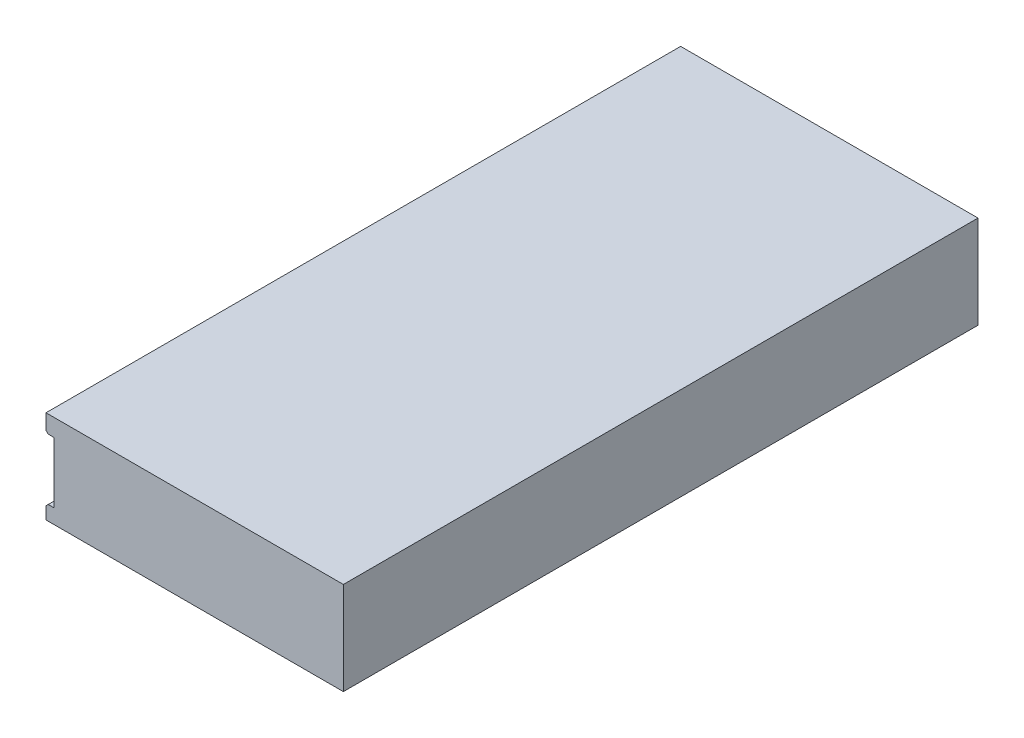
ISO-10303-21;
HEADER;
FILE_DESCRIPTION(('STEP AP214'),'2;1');
FILE_NAME('part.step','',(''),(''),'','','');
FILE_SCHEMA(('AUTOMOTIVE_DESIGN { 1 0 10303 214 1 1 1 1 }'));
ENDSEC;
DATA;
#1=APPLICATION_CONTEXT('core data for automotive mechanical design processes');
#2=APPLICATION_PROTOCOL_DEFINITION('international standard','automotive_design',2000,#1);
#3=PRODUCT_CONTEXT('',#1,'mechanical');
#4=PRODUCT('Part','Part','',(#3));
#5=PRODUCT_RELATED_PRODUCT_CATEGORY('part','',(#4));
#6=PRODUCT_DEFINITION_FORMATION('','',#4);
#7=PRODUCT_DEFINITION_CONTEXT('part definition',#1,'design');
#8=PRODUCT_DEFINITION('design','',#6,#7);
#9=PRODUCT_DEFINITION_SHAPE('','',#8);
#10=(LENGTH_UNIT() NAMED_UNIT(*) SI_UNIT(.MILLI.,.METRE.));
#11=(NAMED_UNIT(*) PLANE_ANGLE_UNIT() SI_UNIT($,.RADIAN.));
#12=(NAMED_UNIT(*) SI_UNIT($,.STERADIAN.) SOLID_ANGLE_UNIT());
#13=UNCERTAINTY_MEASURE_WITH_UNIT(LENGTH_MEASURE(1.E-05),#10,'distance_accuracy_value','');
#14=(GEOMETRIC_REPRESENTATION_CONTEXT(3) GLOBAL_UNCERTAINTY_ASSIGNED_CONTEXT((#13)) GLOBAL_UNIT_ASSIGNED_CONTEXT((#10,
#11,#12)) REPRESENTATION_CONTEXT('',''));
#15=CARTESIAN_POINT('',(0.,0.,0.));
#16=DIRECTION('',(0.,0.,1.));
#17=DIRECTION('',(1.,0.,0.));
#18=AXIS2_PLACEMENT_3D('',#15,#16,#17);
#19=CARTESIAN_POINT('',(-1.397,0.,55.5625));
#20=DIRECTION('',(0.,-1.,0.));
#21=DIRECTION('',(0.,0.,-1.));
#22=AXIS2_PLACEMENT_3D('',#19,#20,#21);
#23=PLANE('',#22);
#24=DIRECTION('',(-1.,0.,0.));
#25=VECTOR('',#24,1.);
#26=CARTESIAN_POINT('',(-1.397,0.,-55.5625));
#27=LINE('',#26,#25);
#28=CARTESIAN_POINT('',(50.673,0.,-55.5625));
#29=VERTEX_POINT('',#28);
#30=CARTESIAN_POINT('',(-1.397,0.,-55.5625));
#31=VERTEX_POINT('',#30);
#32=EDGE_CURVE('E180',#29,#31,#27,.T.);
#33=ORIENTED_EDGE('',*,*,#32,.T.);
#34=DIRECTION('',(0.,0.,-1.));
#35=VECTOR('',#34,1.);
#36=CARTESIAN_POINT('',(-1.397,0.,55.5625));
#37=LINE('',#36,#35);
#38=CARTESIAN_POINT('',(-1.397,0.,55.5625));
#39=VERTEX_POINT('',#38);
#40=EDGE_CURVE('E231',#39,#31,#37,.T.);
#41=ORIENTED_EDGE('',*,*,#40,.F.);
#42=DIRECTION('',(-1.,0.,0.));
#43=VECTOR('',#42,1.);
#44=CARTESIAN_POINT('',(-1.397,0.,55.5625));
#45=LINE('',#44,#43);
#46=CARTESIAN_POINT('',(50.673,0.,55.5625));
#47=VERTEX_POINT('',#46);
#48=EDGE_CURVE('E181',#47,#39,#45,.T.);
#49=ORIENTED_EDGE('',*,*,#48,.F.);
#50=DIRECTION('',(0.,0.,-1.));
#51=VECTOR('',#50,1.);
#52=CARTESIAN_POINT('',(50.673,0.,55.5625));
#53=LINE('',#52,#51);
#54=EDGE_CURVE('E200',#47,#29,#53,.T.);
#55=ORIENTED_EDGE('',*,*,#54,.T.);
#56=EDGE_LOOP('',(#33,#41,#49,#55));
#57=FACE_BOUND('',#56,.T.);
#58=ADVANCED_FACE('F37',(#57),#23,.F.);
#59=CARTESIAN_POINT('',(-1.397,-3.048,55.5625));
#60=DIRECTION('',(1.,0.,0.));
#61=DIRECTION('',(0.,0.,-1.));
#62=AXIS2_PLACEMENT_3D('',#59,#60,#61);
#63=PLANE('',#62);
#64=DIRECTION('',(0.,-1.,0.));
#65=VECTOR('',#64,1.);
#66=CARTESIAN_POINT('',(-1.397,-3.048,-55.5625));
#67=LINE('',#66,#65);
#68=CARTESIAN_POINT('',(-1.397,-2.66700000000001,-55.5625));
#69=VERTEX_POINT('',#68);
#70=EDGE_CURVE('E203',#31,#69,#67,.T.);
#71=ORIENTED_EDGE('',*,*,#70,.T.);
#72=DIRECTION('',(0.,0.,1.));
#73=VECTOR('',#72,1.);
#74=CARTESIAN_POINT('',(-1.397,-2.66700000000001,55.5625));
#75=LINE('',#74,#73);
#76=CARTESIAN_POINT('',(-1.397,-2.66700000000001,55.5625));
#77=VERTEX_POINT('',#76);
#78=EDGE_CURVE('E11',#69,#77,#75,.T.);
#79=ORIENTED_EDGE('',*,*,#78,.T.);
#80=DIRECTION('',(0.,-1.,0.));
#81=VECTOR('',#80,1.);
#82=CARTESIAN_POINT('',(-1.397,-3.048,55.5625));
#83=LINE('',#82,#81);
#84=EDGE_CURVE('E184',#39,#77,#83,.T.);
#85=ORIENTED_EDGE('',*,*,#84,.F.);
#86=ORIENTED_EDGE('',*,*,#40,.T.);
#87=EDGE_LOOP('',(#71,#79,#85,#86));
#88=FACE_BOUND('',#87,.T.);
#89=ADVANCED_FACE('F287',(#88),#63,.F.);
#90=CARTESIAN_POINT('',(0.,-3.048,55.5625));
#91=DIRECTION('',(0.,1.,0.));
#92=DIRECTION('',(0.,0.,1.));
#93=AXIS2_PLACEMENT_3D('',#90,#91,#92);
#94=PLANE('',#93);
#95=DIRECTION('',(1.,0.,0.));
#96=VECTOR('',#95,1.);
#97=CARTESIAN_POINT('',(0.,-3.048,55.5625));
#98=LINE('',#97,#96);
#99=CARTESIAN_POINT('',(-1.016,-3.048,55.5625));
#100=VERTEX_POINT('',#99);
#101=CARTESIAN_POINT('',(0.,-3.048,55.5625));
#102=VERTEX_POINT('',#101);
#103=EDGE_CURVE('E187',#100,#102,#98,.T.);
#104=ORIENTED_EDGE('',*,*,#103,.F.);
#105=DIRECTION('',(0.,0.,-1.));
#106=VECTOR('',#105,1.);
#107=CARTESIAN_POINT('',(-1.016,-3.048,55.5625));
#108=LINE('',#107,#106);
#109=CARTESIAN_POINT('',(-1.016,-3.048,-55.5625));
#110=VERTEX_POINT('',#109);
#111=EDGE_CURVE('E45',#100,#110,#108,.T.);
#112=ORIENTED_EDGE('',*,*,#111,.T.);
#113=DIRECTION('',(1.,0.,0.));
#114=VECTOR('',#113,1.);
#115=CARTESIAN_POINT('',(0.,-3.048,-55.5625));
#116=LINE('',#115,#114);
#117=CARTESIAN_POINT('',(0.,-3.048,-55.5625));
#118=VERTEX_POINT('',#117);
#119=EDGE_CURVE('E205',#110,#118,#116,.T.);
#120=ORIENTED_EDGE('',*,*,#119,.T.);
#121=DIRECTION('',(0.,0.,-1.));
#122=VECTOR('',#121,1.);
#123=CARTESIAN_POINT('',(0.,-3.048,55.5625));
#124=LINE('',#123,#122);
#125=EDGE_CURVE('E228',#102,#118,#124,.T.);
#126=ORIENTED_EDGE('',*,*,#125,.F.);
#127=EDGE_LOOP('',(#104,#112,#120,#126));
#128=FACE_BOUND('',#127,.T.);
#129=ADVANCED_FACE('F249',(#128),#94,.F.);
#130=CARTESIAN_POINT('',(0.,-13.716,55.5625));
#131=DIRECTION('',(1.,0.,0.));
#132=DIRECTION('',(0.,0.,-1.));
#133=AXIS2_PLACEMENT_3D('',#130,#131,#132);
#134=PLANE('',#133);
#135=CARTESIAN_POINT('',(0.,-8.12799999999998,-50.2666));
#136=DIRECTION('',(-1.,0.,0.));
#137=DIRECTION('',(0.,0.,1.));
#138=AXIS2_PLACEMENT_3D('',#135,#136,#137);
#139=CIRCLE('',#138,2.413);
#140=CARTESIAN_POINT('',(0.,-8.12799999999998,-47.8536));
#141=VERTEX_POINT('',#140);
#142=EDGE_CURVE('E141',#141,#141,#139,.T.);
#143=ORIENTED_EDGE('',*,*,#142,.F.);
#144=EDGE_LOOP('',(#143));
#145=FACE_BOUND('',#144,.T.);
#146=CARTESIAN_POINT('',(0.,-8.12800000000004,50.2666));
#147=DIRECTION('',(-1.,0.,0.));
#148=DIRECTION('',(0.,0.,1.));
#149=AXIS2_PLACEMENT_3D('',#146,#147,#148);
#150=CIRCLE('',#149,2.413);
#151=CARTESIAN_POINT('',(0.,-8.12800000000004,52.6796));
#152=VERTEX_POINT('',#151);
#153=EDGE_CURVE('E153',#152,#152,#150,.T.);
#154=ORIENTED_EDGE('',*,*,#153,.F.);
#155=EDGE_LOOP('',(#154));
#156=FACE_BOUND('',#155,.T.);
#157=CARTESIAN_POINT('',(0.,-8.12800000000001,4.8768));
#158=DIRECTION('',(-1.,0.,0.));
#159=DIRECTION('',(0.,0.,1.));
#160=AXIS2_PLACEMENT_3D('',#157,#158,#159);
#161=CIRCLE('',#160,2.413);
#162=CARTESIAN_POINT('',(0.,-8.12800000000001,7.28979999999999));
#163=VERTEX_POINT('',#162);
#164=EDGE_CURVE('E165',#163,#163,#161,.T.);
#165=ORIENTED_EDGE('',*,*,#164,.F.);
#166=EDGE_LOOP('',(#165));
#167=FACE_BOUND('',#166,.T.);
#168=CARTESIAN_POINT('',(0.,-8.12800000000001,-4.8768));
#169=DIRECTION('',(-1.,0.,0.));
#170=DIRECTION('',(0.,0.,1.));
#171=AXIS2_PLACEMENT_3D('',#168,#169,#170);
#172=CIRCLE('',#171,2.413);
#173=CARTESIAN_POINT('',(0.,-8.12800000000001,-2.46380000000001));
#174=VERTEX_POINT('',#173);
#175=EDGE_CURVE('E177',#174,#174,#172,.T.);
#176=ORIENTED_EDGE('',*,*,#175,.F.);
#177=EDGE_LOOP('',(#176));
#178=FACE_BOUND('',#177,.T.);
#179=DIRECTION('',(0.,-1.,0.));
#180=VECTOR('',#179,1.);
#181=CARTESIAN_POINT('',(0.,-13.716,-55.5625));
#182=LINE('',#181,#180);
#183=CARTESIAN_POINT('',(0.,-13.716,-55.5625));
#184=VERTEX_POINT('',#183);
#185=EDGE_CURVE('E207',#118,#184,#182,.T.);
#186=ORIENTED_EDGE('',*,*,#185,.T.);
#187=DIRECTION('',(0.,0.,-1.));
#188=VECTOR('',#187,1.);
#189=CARTESIAN_POINT('',(0.,-13.716,55.5625));
#190=LINE('',#189,#188);
#191=CARTESIAN_POINT('',(0.,-13.716,55.5625));
#192=VERTEX_POINT('',#191);
#193=EDGE_CURVE('E225',#192,#184,#190,.T.);
#194=ORIENTED_EDGE('',*,*,#193,.F.);
#195=DIRECTION('',(0.,-1.,0.));
#196=VECTOR('',#195,1.);
#197=CARTESIAN_POINT('',(0.,-13.716,55.5625));
#198=LINE('',#197,#196);
#199=EDGE_CURVE('E189',#102,#192,#198,.T.);
#200=ORIENTED_EDGE('',*,*,#199,.F.);
#201=ORIENTED_EDGE('',*,*,#125,.T.);
#202=EDGE_LOOP('',(#186,#194,#200,#201));
#203=FACE_BOUND('',#202,.T.);
#204=ADVANCED_FACE('F259',(#145,#156,#167,#178,#203),#134,.F.);
#205=CARTESIAN_POINT('',(-1.397,-13.716,55.5625));
#206=DIRECTION('',(0.,-1.,0.));
#207=DIRECTION('',(0.,0.,-1.));
#208=AXIS2_PLACEMENT_3D('',#205,#206,#207);
#209=PLANE('',#208);
#210=DIRECTION('',(-1.,0.,0.));
#211=VECTOR('',#210,1.);
#212=CARTESIAN_POINT('',(-1.397,-13.716,-55.5625));
#213=LINE('',#212,#211);
#214=CARTESIAN_POINT('',(-1.01599999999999,-13.716,-55.5625));
#215=VERTEX_POINT('',#214);
#216=EDGE_CURVE('E209',#184,#215,#213,.T.);
#217=ORIENTED_EDGE('',*,*,#216,.T.);
#218=DIRECTION('',(0.,0.,1.));
#219=VECTOR('',#218,1.);
#220=CARTESIAN_POINT('',(-1.01599999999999,-13.716,55.5625));
#221=LINE('',#220,#219);
#222=CARTESIAN_POINT('',(-1.01599999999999,-13.716,55.5625));
#223=VERTEX_POINT('',#222);
#224=EDGE_CURVE('E241',#215,#223,#221,.T.);
#225=ORIENTED_EDGE('',*,*,#224,.T.);
#226=DIRECTION('',(-1.,0.,0.));
#227=VECTOR('',#226,1.);
#228=CARTESIAN_POINT('',(-1.397,-13.716,55.5625));
#229=LINE('',#228,#227);
#230=EDGE_CURVE('E191',#192,#223,#229,.T.);
#231=ORIENTED_EDGE('',*,*,#230,.F.);
#232=ORIENTED_EDGE('',*,*,#193,.T.);
#233=EDGE_LOOP('',(#217,#225,#231,#232));
#234=FACE_BOUND('',#233,.T.);
#235=ADVANCED_FACE('F263',(#234),#209,.F.);
#236=CARTESIAN_POINT('',(-1.397,-16.256,55.5625));
#237=DIRECTION('',(1.,0.,0.));
#238=DIRECTION('',(0.,0.,-1.));
#239=AXIS2_PLACEMENT_3D('',#236,#237,#238);
#240=PLANE('',#239);
#241=DIRECTION('',(0.,-1.,0.));
#242=VECTOR('',#241,1.);
#243=CARTESIAN_POINT('',(-1.397,-16.256,55.5625));
#244=LINE('',#243,#242);
#245=CARTESIAN_POINT('',(-1.397,-14.097,55.5625));
#246=VERTEX_POINT('',#245);
#247=CARTESIAN_POINT('',(-1.397,-16.256,55.5625));
#248=VERTEX_POINT('',#247);
#249=EDGE_CURVE('E194',#246,#248,#244,.T.);
#250=ORIENTED_EDGE('',*,*,#249,.F.);
#251=DIRECTION('',(0.,0.,-1.));
#252=VECTOR('',#251,1.);
#253=CARTESIAN_POINT('',(-1.397,-14.097,55.5625));
#254=LINE('',#253,#252);
#255=CARTESIAN_POINT('',(-1.397,-14.097,-55.5625));
#256=VERTEX_POINT('',#255);
#257=EDGE_CURVE('E234',#246,#256,#254,.T.);
#258=ORIENTED_EDGE('',*,*,#257,.T.);
#259=DIRECTION('',(0.,-1.,0.));
#260=VECTOR('',#259,1.);
#261=CARTESIAN_POINT('',(-1.397,-16.256,-55.5625));
#262=LINE('',#261,#260);
#263=CARTESIAN_POINT('',(-1.397,-16.256,-55.5625));
#264=VERTEX_POINT('',#263);
#265=EDGE_CURVE('E212',#256,#264,#262,.T.);
#266=ORIENTED_EDGE('',*,*,#265,.T.);
#267=DIRECTION('',(0.,0.,-1.));
#268=VECTOR('',#267,1.);
#269=CARTESIAN_POINT('',(-1.397,-16.256,55.5625));
#270=LINE('',#269,#268);
#271=EDGE_CURVE('E222',#248,#264,#270,.T.);
#272=ORIENTED_EDGE('',*,*,#271,.F.);
#273=EDGE_LOOP('',(#250,#258,#266,#272));
#274=FACE_BOUND('',#273,.T.);
#275=ADVANCED_FACE('F271',(#274),#240,.F.);
#276=CARTESIAN_POINT('',(50.673,-16.256,55.5625));
#277=DIRECTION('',(0.,1.,0.));
#278=DIRECTION('',(-1.,0.,0.));
#279=AXIS2_PLACEMENT_3D('',#276,#277,#278);
#280=PLANE('',#279);
#281=DIRECTION('',(1.,0.,0.));
#282=VECTOR('',#281,1.);
#283=CARTESIAN_POINT('',(50.673,-16.256,-55.5625));
#284=LINE('',#283,#282);
#285=CARTESIAN_POINT('',(50.673,-16.256,-55.5625));
#286=VERTEX_POINT('',#285);
#287=EDGE_CURVE('E214',#264,#286,#284,.T.);
#288=ORIENTED_EDGE('',*,*,#287,.T.);
#289=DIRECTION('',(0.,0.,-1.));
#290=VECTOR('',#289,1.);
#291=CARTESIAN_POINT('',(50.673,-16.256,55.5625));
#292=LINE('',#291,#290);
#293=CARTESIAN_POINT('',(50.673,-16.256,55.5625));
#294=VERTEX_POINT('',#293);
#295=EDGE_CURVE('E219',#294,#286,#292,.T.);
#296=ORIENTED_EDGE('',*,*,#295,.F.);
#297=DIRECTION('',(1.,0.,0.));
#298=VECTOR('',#297,1.);
#299=CARTESIAN_POINT('',(50.673,-16.256,55.5625));
#300=LINE('',#299,#298);
#301=EDGE_CURVE('E196',#248,#294,#300,.T.);
#302=ORIENTED_EDGE('',*,*,#301,.F.);
#303=ORIENTED_EDGE('',*,*,#271,.T.);
#304=EDGE_LOOP('',(#288,#296,#302,#303));
#305=FACE_BOUND('',#304,.T.);
#306=ADVANCED_FACE('F278',(#305),#280,.F.);
#307=CARTESIAN_POINT('',(50.673,0.,55.5625));
#308=DIRECTION('',(-1.,0.,0.));
#309=DIRECTION('',(0.,-1.,0.));
#310=AXIS2_PLACEMENT_3D('',#307,#308,#309);
#311=PLANE('',#310);
#312=DIRECTION('',(0.,1.,0.));
#313=VECTOR('',#312,1.);
#314=CARTESIAN_POINT('',(50.673,0.,-55.5625));
#315=LINE('',#314,#313);
#316=EDGE_CURVE('E185',#286,#29,#315,.T.);
#317=ORIENTED_EDGE('',*,*,#316,.T.);
#318=ORIENTED_EDGE('',*,*,#54,.F.);
#319=DIRECTION('',(0.,1.,0.));
#320=VECTOR('',#319,1.);
#321=CARTESIAN_POINT('',(50.673,0.,55.5625));
#322=LINE('',#321,#320);
#323=EDGE_CURVE('E198',#294,#47,#322,.T.);
#324=ORIENTED_EDGE('',*,*,#323,.F.);
#325=ORIENTED_EDGE('',*,*,#295,.T.);
#326=EDGE_LOOP('',(#317,#318,#324,#325));
#327=FACE_BOUND('',#326,.T.);
#328=ADVANCED_FACE('F282',(#327),#311,.F.);
#329=CARTESIAN_POINT('',(-1.397,0.,55.5625));
#330=DIRECTION('',(0.,0.,1.));
#331=DIRECTION('',(1.,0.,0.));
#332=AXIS2_PLACEMENT_3D('',#329,#330,#331);
#333=PLANE('',#332);
#334=ORIENTED_EDGE('',*,*,#230,.T.);
#335=DIRECTION('',(0.707106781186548,0.707106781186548,0.));
#336=VECTOR('',#335,1.);
#337=CARTESIAN_POINT('',(5.65150000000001,-7.04850000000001,55.5625));
#338=LINE('',#337,#336);
#339=EDGE_CURVE('E244',#223,#246,#338,.F.);
#340=ORIENTED_EDGE('',*,*,#339,.T.);
#341=ORIENTED_EDGE('',*,*,#249,.T.);
#342=ORIENTED_EDGE('',*,*,#301,.T.);
#343=ORIENTED_EDGE('',*,*,#323,.T.);
#344=ORIENTED_EDGE('',*,*,#48,.T.);
#345=ORIENTED_EDGE('',*,*,#84,.T.);
#346=DIRECTION('',(-0.707106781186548,0.707106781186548,0.));
#347=VECTOR('',#346,1.);
#348=CARTESIAN_POINT('',(-2.7305,-1.3335,55.5625));
#349=LINE('',#348,#347);
#350=EDGE_CURVE('E52',#77,#100,#349,.F.);
#351=ORIENTED_EDGE('',*,*,#350,.T.);
#352=ORIENTED_EDGE('',*,*,#103,.T.);
#353=ORIENTED_EDGE('',*,*,#199,.T.);
#354=EDGE_LOOP('',(#334,#340,#341,#342,#343,#344,#345,#351,#352,#353));
#355=FACE_BOUND('',#354,.T.);
#356=ADVANCED_FACE('F266',(#355),#333,.T.);
#357=CARTESIAN_POINT('',(-1.397,0.,-55.5625));
#358=DIRECTION('',(0.,0.,1.));
#359=DIRECTION('',(1.,0.,0.));
#360=AXIS2_PLACEMENT_3D('',#357,#358,#359);
#361=PLANE('',#360);
#362=ORIENTED_EDGE('',*,*,#265,.F.);
#363=DIRECTION('',(-0.707106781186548,-0.707106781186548,0.));
#364=VECTOR('',#363,1.);
#365=CARTESIAN_POINT('',(-1.397,-14.097,-55.5625));
#366=LINE('',#365,#364);
#367=EDGE_CURVE('E239',#256,#215,#366,.F.);
#368=ORIENTED_EDGE('',*,*,#367,.T.);
#369=ORIENTED_EDGE('',*,*,#216,.F.);
#370=ORIENTED_EDGE('',*,*,#185,.F.);
#371=ORIENTED_EDGE('',*,*,#119,.F.);
#372=DIRECTION('',(0.707106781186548,-0.707106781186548,0.));
#373=VECTOR('',#372,1.);
#374=CARTESIAN_POINT('',(-1.016,-3.048,-55.5625));
#375=LINE('',#374,#373);
#376=EDGE_CURVE('E237',#110,#69,#375,.F.);
#377=ORIENTED_EDGE('',*,*,#376,.T.);
#378=ORIENTED_EDGE('',*,*,#70,.F.);
#379=ORIENTED_EDGE('',*,*,#32,.F.);
#380=ORIENTED_EDGE('',*,*,#316,.F.);
#381=ORIENTED_EDGE('',*,*,#287,.F.);
#382=EDGE_LOOP('',(#362,#368,#369,#370,#371,#377,#378,#379,#380,#381));
#383=FACE_BOUND('',#382,.T.);
#384=ADVANCED_FACE('F255',(#383),#361,.F.);
#385=CARTESIAN_POINT('',(0.,-8.12800000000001,-4.8768));
#386=DIRECTION('',(-1.,0.,0.));
#387=DIRECTION('',(0.,0.,1.));
#388=AXIS2_PLACEMENT_3D('',#385,#386,#387);
#389=CYLINDRICAL_SURFACE('',#388,2.413);
#390=CARTESIAN_POINT('',(7.62,-8.12800000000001,-4.8768));
#391=DIRECTION('',(-1.,0.,0.));
#392=DIRECTION('',(0.,0.,1.));
#393=AXIS2_PLACEMENT_3D('',#390,#391,#392);
#394=CIRCLE('',#393,2.413);
#395=CARTESIAN_POINT('',(7.62,-8.12800000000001,-2.46380000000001));
#396=VERTEX_POINT('',#395);
#397=EDGE_CURVE('E174',#396,#396,#394,.T.);
#398=ORIENTED_EDGE('',*,*,#397,.F.);
#399=EDGE_LOOP('',(#398));
#400=FACE_BOUND('',#399,.T.);
#401=ORIENTED_EDGE('',*,*,#175,.T.);
#402=EDGE_LOOP('',(#401));
#403=FACE_BOUND('',#402,.T.);
#404=ADVANCED_FACE('F314',(#400,#403),#389,.F.);
#405=CARTESIAN_POINT('',(7.62,-6.10870000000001,-4.8768));
#406=DIRECTION('',(1.,0.,0.));
#407=DIRECTION('',(0.,0.,-1.));
#408=AXIS2_PLACEMENT_3D('',#405,#406,#407);
#409=PLANE('',#408);
#410=CARTESIAN_POINT('',(7.62,-8.12800000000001,-4.8768));
#411=DIRECTION('',(-1.,0.,0.));
#412=DIRECTION('',(0.,0.,1.));
#413=AXIS2_PLACEMENT_3D('',#410,#411,#412);
#414=CIRCLE('',#413,2.0193);
#415=CARTESIAN_POINT('',(7.62,-8.12800000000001,-2.85750000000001));
#416=VERTEX_POINT('',#415);
#417=EDGE_CURVE('E171',#416,#416,#414,.T.);
#418=ORIENTED_EDGE('',*,*,#417,.F.);
#419=EDGE_LOOP('',(#418));
#420=FACE_BOUND('',#419,.T.);
#421=ORIENTED_EDGE('',*,*,#397,.T.);
#422=EDGE_LOOP('',(#421));
#423=FACE_BOUND('',#422,.T.);
#424=ADVANCED_FACE('F319',(#420,#423),#409,.F.);
#425=CARTESIAN_POINT('',(0.,-8.12800000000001,-4.8768));
#426=DIRECTION('',(-1.,0.,0.));
#427=DIRECTION('',(0.,0.,1.));
#428=AXIS2_PLACEMENT_3D('',#425,#426,#427);
#429=CYLINDRICAL_SURFACE('',#428,2.0193);
#430=CARTESIAN_POINT('',(9.99744,-8.12800000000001,-4.8768));
#431=DIRECTION('',(-1.,0.,0.));
#432=DIRECTION('',(0.,0.,1.));
#433=AXIS2_PLACEMENT_3D('',#430,#431,#432);
#434=CIRCLE('',#433,2.0193);
#435=CARTESIAN_POINT('',(9.99744,-8.12800000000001,-2.85750000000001));
#436=VERTEX_POINT('',#435);
#437=EDGE_CURVE('E168',#436,#436,#434,.T.);
#438=ORIENTED_EDGE('',*,*,#437,.F.);
#439=EDGE_LOOP('',(#438));
#440=FACE_BOUND('',#439,.T.);
#441=ORIENTED_EDGE('',*,*,#417,.T.);
#442=EDGE_LOOP('',(#441));
#443=FACE_BOUND('',#442,.T.);
#444=ADVANCED_FACE('F323',(#440,#443),#429,.F.);
#445=CARTESIAN_POINT('',(9.99744,-8.12800000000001,-4.8768));
#446=DIRECTION('',(-1.,0.,0.));
#447=DIRECTION('',(0.,0.,1.));
#448=AXIS2_PLACEMENT_3D('',#445,#446,#447);
#449=CONICAL_SURFACE('',#448,2.0193,1.02974425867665);
#450=CARTESIAN_POINT('',(11.2107578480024,-8.12800000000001,-4.8768));
#451=VERTEX_POINT('',#450);
#452=VERTEX_LOOP('',#451);
#453=FACE_BOUND('',#452,.T.);
#454=ORIENTED_EDGE('',*,*,#437,.T.);
#455=EDGE_LOOP('',(#454));
#456=FACE_BOUND('',#455,.T.);
#457=ADVANCED_FACE('F327',(#453,#456),#449,.F.);
#458=CARTESIAN_POINT('',(0.,-8.12800000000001,4.8768));
#459=DIRECTION('',(-1.,0.,0.));
#460=DIRECTION('',(0.,0.,1.));
#461=AXIS2_PLACEMENT_3D('',#458,#459,#460);
#462=CYLINDRICAL_SURFACE('',#461,2.413);
#463=CARTESIAN_POINT('',(7.62,-8.12800000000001,4.8768));
#464=DIRECTION('',(-1.,0.,0.));
#465=DIRECTION('',(0.,0.,1.));
#466=AXIS2_PLACEMENT_3D('',#463,#464,#465);
#467=CIRCLE('',#466,2.413);
#468=CARTESIAN_POINT('',(7.62,-8.12800000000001,7.28979999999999));
#469=VERTEX_POINT('',#468);
#470=EDGE_CURVE('E162',#469,#469,#467,.T.);
#471=ORIENTED_EDGE('',*,*,#470,.F.);
#472=EDGE_LOOP('',(#471));
#473=FACE_BOUND('',#472,.T.);
#474=ORIENTED_EDGE('',*,*,#164,.T.);
#475=EDGE_LOOP('',(#474));
#476=FACE_BOUND('',#475,.T.);
#477=ADVANCED_FACE('F331',(#473,#476),#462,.F.);
#478=CARTESIAN_POINT('',(7.62,-6.10870000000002,4.8768));
#479=DIRECTION('',(1.,0.,0.));
#480=DIRECTION('',(0.,0.,-1.));
#481=AXIS2_PLACEMENT_3D('',#478,#479,#480);
#482=PLANE('',#481);
#483=CARTESIAN_POINT('',(7.62,-8.12800000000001,4.8768));
#484=DIRECTION('',(-1.,0.,0.));
#485=DIRECTION('',(0.,0.,1.));
#486=AXIS2_PLACEMENT_3D('',#483,#484,#485);
#487=CIRCLE('',#486,2.0193);
#488=CARTESIAN_POINT('',(7.62,-8.12800000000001,6.89609999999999));
#489=VERTEX_POINT('',#488);
#490=EDGE_CURVE('E159',#489,#489,#487,.T.);
#491=ORIENTED_EDGE('',*,*,#490,.F.);
#492=EDGE_LOOP('',(#491));
#493=FACE_BOUND('',#492,.T.);
#494=ORIENTED_EDGE('',*,*,#470,.T.);
#495=EDGE_LOOP('',(#494));
#496=FACE_BOUND('',#495,.T.);
#497=ADVANCED_FACE('F335',(#493,#496),#482,.F.);
#498=CARTESIAN_POINT('',(0.,-8.12800000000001,4.8768));
#499=DIRECTION('',(-1.,0.,0.));
#500=DIRECTION('',(0.,0.,1.));
#501=AXIS2_PLACEMENT_3D('',#498,#499,#500);
#502=CYLINDRICAL_SURFACE('',#501,2.0193);
#503=CARTESIAN_POINT('',(9.99744,-8.12800000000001,4.8768));
#504=DIRECTION('',(-1.,0.,0.));
#505=DIRECTION('',(0.,0.,1.));
#506=AXIS2_PLACEMENT_3D('',#503,#504,#505);
#507=CIRCLE('',#506,2.0193);
#508=CARTESIAN_POINT('',(9.99744,-8.12800000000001,6.89609999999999));
#509=VERTEX_POINT('',#508);
#510=EDGE_CURVE('E156',#509,#509,#507,.T.);
#511=ORIENTED_EDGE('',*,*,#510,.F.);
#512=EDGE_LOOP('',(#511));
#513=FACE_BOUND('',#512,.T.);
#514=ORIENTED_EDGE('',*,*,#490,.T.);
#515=EDGE_LOOP('',(#514));
#516=FACE_BOUND('',#515,.T.);
#517=ADVANCED_FACE('F339',(#513,#516),#502,.F.);
#518=CARTESIAN_POINT('',(9.99744,-8.12800000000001,4.8768));
#519=DIRECTION('',(-1.,0.,0.));
#520=DIRECTION('',(0.,0.,1.));
#521=AXIS2_PLACEMENT_3D('',#518,#519,#520);
#522=CONICAL_SURFACE('',#521,2.0193,1.02974425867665);
#523=CARTESIAN_POINT('',(11.2107578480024,-8.12800000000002,4.8768));
#524=VERTEX_POINT('',#523);
#525=VERTEX_LOOP('',#524);
#526=FACE_BOUND('',#525,.T.);
#527=ORIENTED_EDGE('',*,*,#510,.T.);
#528=EDGE_LOOP('',(#527));
#529=FACE_BOUND('',#528,.T.);
#530=ADVANCED_FACE('F343',(#526,#529),#522,.F.);
#531=CARTESIAN_POINT('',(0.,-8.12800000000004,50.2666));
#532=DIRECTION('',(-1.,0.,0.));
#533=DIRECTION('',(0.,0.,1.));
#534=AXIS2_PLACEMENT_3D('',#531,#532,#533);
#535=CYLINDRICAL_SURFACE('',#534,2.413);
#536=CARTESIAN_POINT('',(7.62000000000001,-8.12800000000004,50.2666));
#537=DIRECTION('',(-1.,0.,0.));
#538=DIRECTION('',(0.,0.,1.));
#539=AXIS2_PLACEMENT_3D('',#536,#537,#538);
#540=CIRCLE('',#539,2.413);
#541=CARTESIAN_POINT('',(7.62000000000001,-8.12800000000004,52.6796));
#542=VERTEX_POINT('',#541);
#543=EDGE_CURVE('E150',#542,#542,#540,.T.);
#544=ORIENTED_EDGE('',*,*,#543,.F.);
#545=EDGE_LOOP('',(#544));
#546=FACE_BOUND('',#545,.T.);
#547=ORIENTED_EDGE('',*,*,#153,.T.);
#548=EDGE_LOOP('',(#547));
#549=FACE_BOUND('',#548,.T.);
#550=ADVANCED_FACE('F347',(#546,#549),#535,.F.);
#551=CARTESIAN_POINT('',(7.62000000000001,-6.10870000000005,50.2666));
#552=DIRECTION('',(1.,0.,0.));
#553=DIRECTION('',(0.,0.,-1.));
#554=AXIS2_PLACEMENT_3D('',#551,#552,#553);
#555=PLANE('',#554);
#556=CARTESIAN_POINT('',(7.62000000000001,-8.12800000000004,50.2666));
#557=DIRECTION('',(-1.,0.,0.));
#558=DIRECTION('',(0.,0.,1.));
#559=AXIS2_PLACEMENT_3D('',#556,#557,#558);
#560=CIRCLE('',#559,2.0193);
#561=CARTESIAN_POINT('',(7.62000000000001,-8.12800000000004,52.2859));
#562=VERTEX_POINT('',#561);
#563=EDGE_CURVE('E147',#562,#562,#560,.T.);
#564=ORIENTED_EDGE('',*,*,#563,.F.);
#565=EDGE_LOOP('',(#564));
#566=FACE_BOUND('',#565,.T.);
#567=ORIENTED_EDGE('',*,*,#543,.T.);
#568=EDGE_LOOP('',(#567));
#569=FACE_BOUND('',#568,.T.);
#570=ADVANCED_FACE('F351',(#566,#569),#555,.F.);
#571=CARTESIAN_POINT('',(0.,-8.12800000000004,50.2666));
#572=DIRECTION('',(-1.,0.,0.));
#573=DIRECTION('',(0.,0.,1.));
#574=AXIS2_PLACEMENT_3D('',#571,#572,#573);
#575=CYLINDRICAL_SURFACE('',#574,2.0193);
#576=CARTESIAN_POINT('',(9.99744000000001,-8.12800000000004,50.2666));
#577=DIRECTION('',(-1.,0.,0.));
#578=DIRECTION('',(0.,0.,1.));
#579=AXIS2_PLACEMENT_3D('',#576,#577,#578);
#580=CIRCLE('',#579,2.0193);
#581=CARTESIAN_POINT('',(9.99744000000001,-8.12800000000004,52.2859));
#582=VERTEX_POINT('',#581);
#583=EDGE_CURVE('E144',#582,#582,#580,.T.);
#584=ORIENTED_EDGE('',*,*,#583,.F.);
#585=EDGE_LOOP('',(#584));
#586=FACE_BOUND('',#585,.T.);
#587=ORIENTED_EDGE('',*,*,#563,.T.);
#588=EDGE_LOOP('',(#587));
#589=FACE_BOUND('',#588,.T.);
#590=ADVANCED_FACE('F355',(#586,#589),#575,.F.);
#591=CARTESIAN_POINT('',(9.99744000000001,-8.12800000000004,50.2666));
#592=DIRECTION('',(-1.,0.,0.));
#593=DIRECTION('',(0.,0.,1.));
#594=AXIS2_PLACEMENT_3D('',#591,#592,#593);
#595=CONICAL_SURFACE('',#594,2.0193,1.02974425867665);
#596=CARTESIAN_POINT('',(11.2107578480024,-8.12800000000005,50.2666));
#597=VERTEX_POINT('',#596);
#598=VERTEX_LOOP('',#597);
#599=FACE_BOUND('',#598,.T.);
#600=ORIENTED_EDGE('',*,*,#583,.T.);
#601=EDGE_LOOP('',(#600));
#602=FACE_BOUND('',#601,.T.);
#603=ADVANCED_FACE('F359',(#599,#602),#595,.F.);
#604=CARTESIAN_POINT('',(0.,-8.12799999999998,-50.2666));
#605=DIRECTION('',(-1.,0.,0.));
#606=DIRECTION('',(0.,0.,1.));
#607=AXIS2_PLACEMENT_3D('',#604,#605,#606);
#608=CYLINDRICAL_SURFACE('',#607,2.413);
#609=CARTESIAN_POINT('',(7.62,-8.12799999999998,-50.2666));
#610=DIRECTION('',(-1.,0.,0.));
#611=DIRECTION('',(0.,0.,1.));
#612=AXIS2_PLACEMENT_3D('',#609,#610,#611);
#613=CIRCLE('',#612,2.413);
#614=CARTESIAN_POINT('',(7.62,-8.12799999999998,-47.8536));
#615=VERTEX_POINT('',#614);
#616=EDGE_CURVE('E136',#615,#615,#613,.T.);
#617=ORIENTED_EDGE('',*,*,#616,.F.);
#618=EDGE_LOOP('',(#617));
#619=FACE_BOUND('',#618,.T.);
#620=ORIENTED_EDGE('',*,*,#142,.T.);
#621=EDGE_LOOP('',(#620));
#622=FACE_BOUND('',#621,.T.);
#623=ADVANCED_FACE('F363',(#619,#622),#608,.F.);
#624=CARTESIAN_POINT('',(7.62,-6.10869999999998,-50.2666));
#625=DIRECTION('',(1.,0.,0.));
#626=DIRECTION('',(0.,0.,-1.));
#627=AXIS2_PLACEMENT_3D('',#624,#625,#626);
#628=PLANE('',#627);
#629=CARTESIAN_POINT('',(7.62,-8.12799999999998,-50.2666));
#630=DIRECTION('',(-1.,0.,0.));
#631=DIRECTION('',(0.,0.,1.));
#632=AXIS2_PLACEMENT_3D('',#629,#630,#631);
#633=CIRCLE('',#632,2.0193);
#634=CARTESIAN_POINT('',(7.62,-8.12799999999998,-48.2473));
#635=VERTEX_POINT('',#634);
#636=EDGE_CURVE('E133',#635,#635,#633,.T.);
#637=ORIENTED_EDGE('',*,*,#636,.F.);
#638=EDGE_LOOP('',(#637));
#639=FACE_BOUND('',#638,.T.);
#640=ORIENTED_EDGE('',*,*,#616,.T.);
#641=EDGE_LOOP('',(#640));
#642=FACE_BOUND('',#641,.T.);
#643=ADVANCED_FACE('F367',(#639,#642),#628,.F.);
#644=CARTESIAN_POINT('',(0.,-8.12799999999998,-50.2666));
#645=DIRECTION('',(-1.,0.,0.));
#646=DIRECTION('',(0.,0.,1.));
#647=AXIS2_PLACEMENT_3D('',#644,#645,#646);
#648=CYLINDRICAL_SURFACE('',#647,2.0193);
#649=CARTESIAN_POINT('',(9.99744,-8.12799999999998,-50.2666));
#650=DIRECTION('',(-1.,0.,0.));
#651=DIRECTION('',(0.,0.,1.));
#652=AXIS2_PLACEMENT_3D('',#649,#650,#651);
#653=CIRCLE('',#652,2.0193);
#654=CARTESIAN_POINT('',(9.99744,-8.12799999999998,-48.2473));
#655=VERTEX_POINT('',#654);
#656=EDGE_CURVE('E131',#655,#655,#653,.T.);
#657=ORIENTED_EDGE('',*,*,#656,.F.);
#658=EDGE_LOOP('',(#657));
#659=FACE_BOUND('',#658,.T.);
#660=ORIENTED_EDGE('',*,*,#636,.T.);
#661=EDGE_LOOP('',(#660));
#662=FACE_BOUND('',#661,.T.);
#663=ADVANCED_FACE('F127',(#659,#662),#648,.F.);
#664=CARTESIAN_POINT('',(9.99744,-8.12799999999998,-50.2666));
#665=DIRECTION('',(-1.,0.,0.));
#666=DIRECTION('',(0.,0.,1.));
#667=AXIS2_PLACEMENT_3D('',#664,#665,#666);
#668=CONICAL_SURFACE('',#667,2.0193,1.02974425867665);
#669=CARTESIAN_POINT('',(11.2107578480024,-8.12799999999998,-50.2666));
#670=VERTEX_POINT('',#669);
#671=VERTEX_LOOP('',#670);
#672=FACE_BOUND('',#671,.T.);
#673=ORIENTED_EDGE('',*,*,#656,.T.);
#674=EDGE_LOOP('',(#673));
#675=FACE_BOUND('',#674,.T.);
#676=ADVANCED_FACE('F123',(#672,#675),#668,.F.);
#677=CARTESIAN_POINT('',(-1.397,-14.097,55.5625));
#678=DIRECTION('',(0.707106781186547,-0.707106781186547,0.));
#679=DIRECTION('',(0.707106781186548,0.707106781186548,0.));
#680=AXIS2_PLACEMENT_3D('',#677,#678,#679);
#681=PLANE('',#680);
#682=ORIENTED_EDGE('',*,*,#339,.F.);
#683=ORIENTED_EDGE('',*,*,#224,.F.);
#684=ORIENTED_EDGE('',*,*,#367,.F.);
#685=ORIENTED_EDGE('',*,*,#257,.F.);
#686=EDGE_LOOP('',(#682,#683,#684,#685));
#687=FACE_BOUND('',#686,.T.);
#688=ADVANCED_FACE('F126',(#687),#681,.F.);
#689=CARTESIAN_POINT('',(-1.016,-3.048,55.5625));
#690=DIRECTION('',(0.707106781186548,0.707106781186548,0.));
#691=DIRECTION('',(-0.707106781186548,0.707106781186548,0.));
#692=AXIS2_PLACEMENT_3D('',#689,#690,#691);
#693=PLANE('',#692);
#694=ORIENTED_EDGE('',*,*,#350,.F.);
#695=ORIENTED_EDGE('',*,*,#78,.F.);
#696=ORIENTED_EDGE('',*,*,#376,.F.);
#697=ORIENTED_EDGE('',*,*,#111,.F.);
#698=EDGE_LOOP('',(#694,#695,#696,#697));
#699=FACE_BOUND('',#698,.T.);
#700=ADVANCED_FACE('F39',(#699),#693,.F.);
#701=CLOSED_SHELL('',(#58,#89,#129,#204,#235,#275,#306,#328,#356,#384,#404,#424,#444,#457,#477,
#497,#517,#530,#550,#570,#590,#603,#623,#643,#663,#676,#688,#700));
#702=MANIFOLD_SOLID_BREP('B2',#701);
#703=ADVANCED_BREP_SHAPE_REPRESENTATION('',(#18,#702),#14);
#704=SHAPE_DEFINITION_REPRESENTATION(#9,#703);
ENDSEC;
END-ISO-10303-21;
